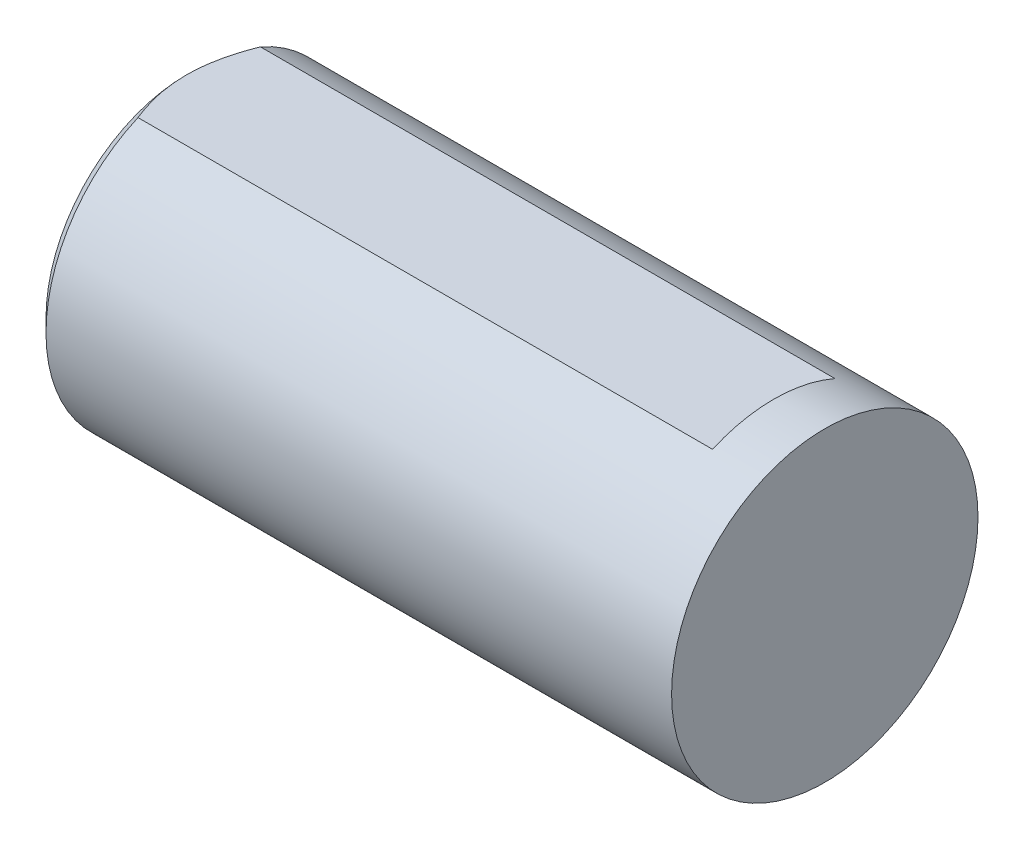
ISO-10303-21;
HEADER;
FILE_DESCRIPTION(('STEP AP214'),'2;1');
FILE_NAME('part.step','',(''),(''),'','','');
FILE_SCHEMA(('AUTOMOTIVE_DESIGN { 1 0 10303 214 1 1 1 1 }'));
ENDSEC;
DATA;
#1=APPLICATION_CONTEXT('core data for automotive mechanical design processes');
#2=APPLICATION_PROTOCOL_DEFINITION('international standard','automotive_design',2000,#1);
#3=PRODUCT_CONTEXT('',#1,'mechanical');
#4=PRODUCT('Part','Part','',(#3));
#5=PRODUCT_RELATED_PRODUCT_CATEGORY('part','',(#4));
#6=PRODUCT_DEFINITION_FORMATION('','',#4);
#7=PRODUCT_DEFINITION_CONTEXT('part definition',#1,'design');
#8=PRODUCT_DEFINITION('design','',#6,#7);
#9=PRODUCT_DEFINITION_SHAPE('','',#8);
#10=(LENGTH_UNIT() NAMED_UNIT(*) SI_UNIT(.MILLI.,.METRE.));
#11=(NAMED_UNIT(*) PLANE_ANGLE_UNIT() SI_UNIT($,.RADIAN.));
#12=(NAMED_UNIT(*) SI_UNIT($,.STERADIAN.) SOLID_ANGLE_UNIT());
#13=UNCERTAINTY_MEASURE_WITH_UNIT(LENGTH_MEASURE(1.E-05),#10,'distance_accuracy_value','');
#14=(GEOMETRIC_REPRESENTATION_CONTEXT(3) GLOBAL_UNCERTAINTY_ASSIGNED_CONTEXT((#13)) GLOBAL_UNIT_ASSIGNED_CONTEXT((#10,
#11,#12)) REPRESENTATION_CONTEXT('',''));
#15=CARTESIAN_POINT('',(0.,0.,0.));
#16=DIRECTION('',(0.,0.,1.));
#17=DIRECTION('',(1.,0.,0.));
#18=AXIS2_PLACEMENT_3D('',#15,#16,#17);
#19=CARTESIAN_POINT('',(-25.,0.,0.));
#20=DIRECTION('',(-1.,0.,0.));
#21=DIRECTION('',(0.,0.,1.));
#22=AXIS2_PLACEMENT_3D('',#19,#20,#21);
#23=PLANE('',#22);
#24=CARTESIAN_POINT('',(-25.,0.,0.));
#25=DIRECTION('',(-1.,0.,0.));
#26=DIRECTION('',(0.,0.,1.));
#27=AXIS2_PLACEMENT_3D('',#24,#25,#26);
#28=CIRCLE('',#27,5.49999999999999);
#29=CARTESIAN_POINT('',(-25.,5.5,0.));
#30=VERTEX_POINT('',#29);
#31=EDGE_CURVE('E11',#30,#30,#28,.T.);
#32=ORIENTED_EDGE('',*,*,#31,.T.);
#33=EDGE_LOOP('',(#32));
#34=FACE_BOUND('',#33,.T.);
#35=ADVANCED_FACE('F29',(#34),#23,.T.);
#36=CARTESIAN_POINT('',(0.,0.,0.));
#37=DIRECTION('',(1.,0.,0.));
#38=DIRECTION('',(0.,0.,-1.));
#39=AXIS2_PLACEMENT_3D('',#36,#37,#38);
#40=CYLINDRICAL_SURFACE('',#39,6.);
#41=DIRECTION('',(-1.,0.,0.));
#42=VECTOR('',#41,1.);
#43=CARTESIAN_POINT('',(-1.99999999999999,5.5,2.39791576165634));
#44=LINE('',#43,#42);
#45=CARTESIAN_POINT('',(-1.99999999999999,5.5,2.39791576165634));
#46=VERTEX_POINT('',#45);
#47=CARTESIAN_POINT('',(-24.5,5.5,2.39791576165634));
#48=VERTEX_POINT('',#47);
#49=EDGE_CURVE('E68',#46,#48,#44,.T.);
#50=ORIENTED_EDGE('',*,*,#49,.T.);
#51=CARTESIAN_POINT('',(-24.5,0.,0.));
#52=DIRECTION('',(-1.,0.,0.));
#53=DIRECTION('',(0.,0.,1.));
#54=AXIS2_PLACEMENT_3D('',#51,#52,#53);
#55=CIRCLE('',#54,6.);
#56=CARTESIAN_POINT('',(-24.5,5.5,-2.39791576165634));
#57=VERTEX_POINT('',#56);
#58=EDGE_CURVE('E74',#48,#57,#55,.F.);
#59=ORIENTED_EDGE('',*,*,#58,.T.);
#60=DIRECTION('',(-1.,0.,0.));
#61=VECTOR('',#60,1.);
#62=CARTESIAN_POINT('',(-1.99999999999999,5.5,-2.39791576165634));
#63=LINE('',#62,#61);
#64=CARTESIAN_POINT('',(-1.99999999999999,5.5,-2.39791576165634));
#65=VERTEX_POINT('',#64);
#66=EDGE_CURVE('E67',#65,#57,#63,.T.);
#67=ORIENTED_EDGE('',*,*,#66,.F.);
#68=CARTESIAN_POINT('',(-1.99999999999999,0.,0.));
#69=DIRECTION('',(-1.,0.,0.));
#70=DIRECTION('',(0.,0.,1.));
#71=AXIS2_PLACEMENT_3D('',#68,#69,#70);
#72=CIRCLE('',#71,6.);
#73=EDGE_CURVE('E58',#46,#65,#72,.T.);
#74=ORIENTED_EDGE('',*,*,#73,.F.);
#75=EDGE_LOOP('',(#50,#59,#67,#74));
#76=FACE_BOUND('',#75,.T.);
#77=CARTESIAN_POINT('',(0.,0.,0.));
#78=DIRECTION('',(1.,0.,0.));
#79=DIRECTION('',(0.,0.,-1.));
#80=AXIS2_PLACEMENT_3D('',#77,#78,#79);
#81=CIRCLE('',#80,6.);
#82=CARTESIAN_POINT('',(0.,0.,-6.));
#83=VERTEX_POINT('',#82);
#84=EDGE_CURVE('E76',#83,#83,#81,.T.);
#85=ORIENTED_EDGE('',*,*,#84,.F.);
#86=EDGE_LOOP('',(#85));
#87=FACE_BOUND('',#86,.T.);
#88=ADVANCED_FACE('F71',(#76,#87),#40,.T.);
#89=CARTESIAN_POINT('',(0.,6.,0.));
#90=DIRECTION('',(1.,0.,0.));
#91=DIRECTION('',(0.,0.,-1.));
#92=AXIS2_PLACEMENT_3D('',#89,#90,#91);
#93=PLANE('',#92);
#94=ORIENTED_EDGE('',*,*,#84,.T.);
#95=EDGE_LOOP('',(#94));
#96=FACE_BOUND('',#95,.T.);
#97=ADVANCED_FACE('F96',(#96),#93,.T.);
#98=CARTESIAN_POINT('',(-1.99999999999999,5.5,-2.39791576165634));
#99=DIRECTION('',(0.,-1.,0.));
#100=DIRECTION('',(0.,0.,-1.));
#101=AXIS2_PLACEMENT_3D('',#98,#99,#100);
#102=PLANE('',#101);
#103=ORIENTED_EDGE('',*,*,#66,.T.);
#104=CARTESIAN_POINT('',(-24.5,5.5,-2.39791576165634));
#105=CARTESIAN_POINT('',(-24.5764881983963,5.5,-2.20666486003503));
#106=CARTESIAN_POINT('',(-24.6463902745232,5.5,-2.01243006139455));
#107=CARTESIAN_POINT('',(-24.7691681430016,5.5,-1.62065312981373));
#108=CARTESIAN_POINT('',(-24.8221943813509,5.5,-1.42315774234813));
#109=CARTESIAN_POINT('',(-24.887253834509,5.5,-1.12359700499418));
#110=CARTESIAN_POINT('',(-24.906537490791,5.5,-1.02310132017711));
#111=CARTESIAN_POINT('',(-24.9399148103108,5.5,-0.821248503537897));
#112=CARTESIAN_POINT('',(-24.9540086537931,5.5,-0.719891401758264));
#113=CARTESIAN_POINT('',(-24.9768220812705,5.5,-0.515628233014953));
#114=CARTESIAN_POINT('',(-24.9854911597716,5.5,-0.412716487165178));
#115=CARTESIAN_POINT('',(-24.997091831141,5.5,-0.206539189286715));
#116=CARTESIAN_POINT('',(-25.0000216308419,5.5,-0.103273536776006));
#117=CARTESIAN_POINT('',(-25.,5.5,0.));
#118=B_SPLINE_CURVE_WITH_KNOTS('',3,(#104,#105,#106,#107,#108,#109,#110,#111,#112,#113,#114,
#115,#116,#117),.UNSPECIFIED.,.F.,.F.,(4,2,2,2,2,2,4),(0.,0.618334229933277,1.23099075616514,
1.53785513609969,1.84470885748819,2.15437851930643,2.46414491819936),.UNSPECIFIED.);
#119=EDGE_CURVE('E36',#57,#30,#118,.T.);
#120=ORIENTED_EDGE('',*,*,#119,.T.);
#121=CARTESIAN_POINT('',(-25.,5.49999999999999,0.));
#122=CARTESIAN_POINT('',(-25.0000067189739,5.5,0.0843667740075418));
#123=CARTESIAN_POINT('',(-24.9980578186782,5.5,0.168720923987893));
#124=CARTESIAN_POINT('',(-24.9903121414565,5.5,0.337239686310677));
#125=CARTESIAN_POINT('',(-24.9845159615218,5.5,0.421404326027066));
#126=CARTESIAN_POINT('',(-24.961476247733,5.5,0.673126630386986));
#127=CARTESIAN_POINT('',(-24.9385811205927,5.5,0.840195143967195));
#128=CARTESIAN_POINT('',(-24.8793165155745,5.5,1.16963481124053));
#129=CARTESIAN_POINT('',(-24.8431243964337,5.5,1.33203875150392));
#130=CARTESIAN_POINT('',(-24.7588599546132,5.5,1.65372090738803));
#131=CARTESIAN_POINT('',(-24.7107872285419,5.5,1.81299901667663));
#132=CARTESIAN_POINT('',(-24.6334241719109,5.5,2.04237408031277));
#133=CARTESIAN_POINT('',(-24.6081400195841,5.5,2.11385610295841));
#134=CARTESIAN_POINT('',(-24.5555420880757,5.5,2.25631795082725));
#135=CARTESIAN_POINT('',(-24.5282223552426,5.5,2.32729558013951));
#136=CARTESIAN_POINT('',(-24.5,5.5,2.39791576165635));
#137=B_SPLINE_CURVE_WITH_KNOTS('',3,(#121,#122,#123,#124,#125,#126,#127,#128,#129,#130,#131,
#132,#133,#134,#135,#136),.UNSPECIFIED.,.F.,.F.,(4,2,2,2,2,2,2,4),(0.,0.253053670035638,
0.506068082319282,1.01125269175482,1.50993013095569,2.00862450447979,2.23606855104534,
2.4642061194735),.UNSPECIFIED.);
#138=EDGE_CURVE('E46',#30,#48,#137,.T.);
#139=ORIENTED_EDGE('',*,*,#138,.T.);
#140=ORIENTED_EDGE('',*,*,#49,.F.);
#141=DIRECTION('',(0.,0.,1.));
#142=VECTOR('',#141,1.);
#143=CARTESIAN_POINT('',(-1.99999999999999,5.5,-2.39791576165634));
#144=LINE('',#143,#142);
#145=EDGE_CURVE('E61',#65,#46,#144,.T.);
#146=ORIENTED_EDGE('',*,*,#145,.F.);
#147=EDGE_LOOP('',(#103,#120,#139,#140,#146));
#148=FACE_BOUND('',#147,.T.);
#149=ADVANCED_FACE('F66',(#148),#102,.F.);
#150=CARTESIAN_POINT('',(-1.99999999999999,0.,0.));
#151=DIRECTION('',(-1.,0.,0.));
#152=DIRECTION('',(0.,0.,1.));
#153=AXIS2_PLACEMENT_3D('',#150,#151,#152);
#154=PLANE('',#153);
#155=ORIENTED_EDGE('',*,*,#73,.T.);
#156=ORIENTED_EDGE('',*,*,#145,.T.);
#157=EDGE_LOOP('',(#155,#156));
#158=FACE_BOUND('',#157,.T.);
#159=ADVANCED_FACE('F60',(#158),#154,.T.);
#160=CARTESIAN_POINT('',(-24.5,0.,0.));
#161=DIRECTION('',(1.,0.,0.));
#162=DIRECTION('',(0.,0.,-1.));
#163=AXIS2_PLACEMENT_3D('',#160,#161,#162);
#164=CONICAL_SURFACE('',#163,6.,0.785398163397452);
#165=ORIENTED_EDGE('',*,*,#138,.F.);
#166=ORIENTED_EDGE('',*,*,#31,.F.);
#167=ORIENTED_EDGE('',*,*,#119,.F.);
#168=ORIENTED_EDGE('',*,*,#58,.F.);
#169=EDGE_LOOP('',(#165,#166,#167,#168));
#170=FACE_BOUND('',#169,.T.);
#171=ADVANCED_FACE('F90',(#170),#164,.T.);
#172=CLOSED_SHELL('',(#35,#88,#97,#149,#159,#171));
#173=MANIFOLD_SOLID_BREP('B2',#172);
#174=ADVANCED_BREP_SHAPE_REPRESENTATION('',(#18,#173),#14);
#175=SHAPE_DEFINITION_REPRESENTATION(#9,#174);
ENDSEC;
END-ISO-10303-21;
